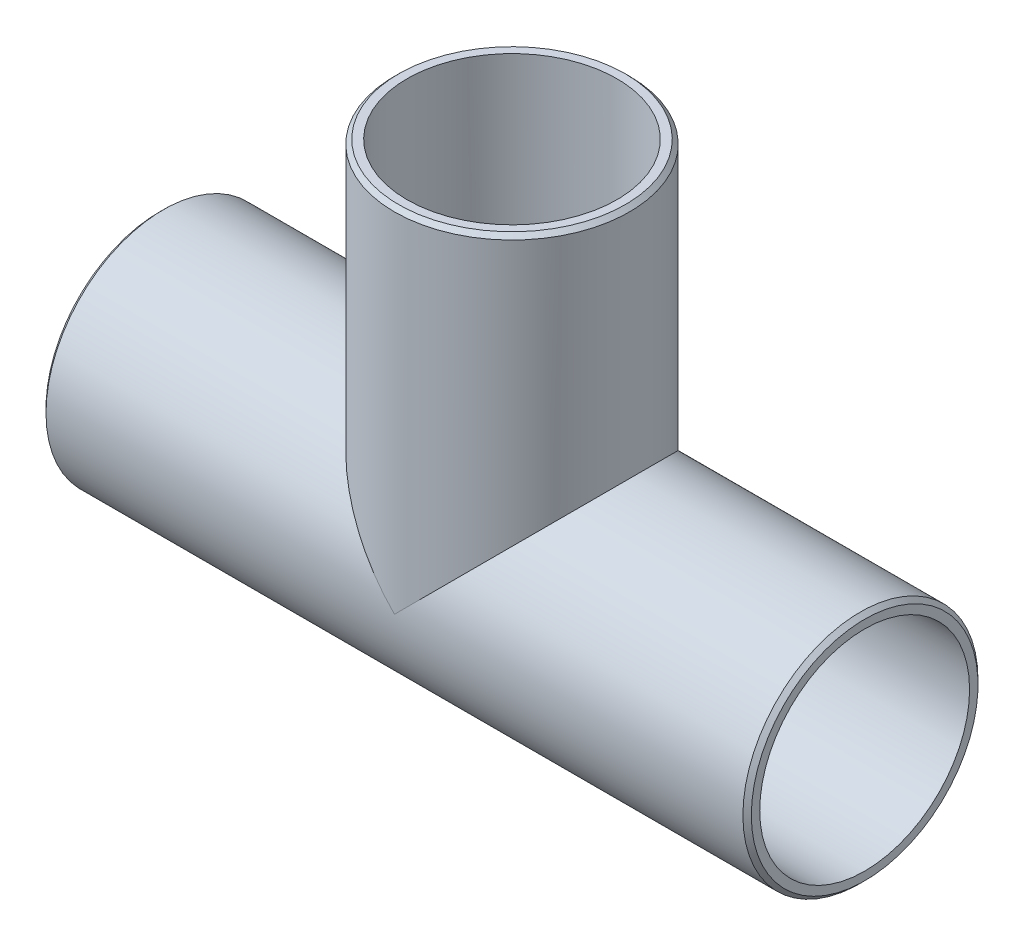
ISO-10303-21;
HEADER;
FILE_DESCRIPTION(('STEP AP214'),'2;1');
FILE_NAME('part.step','',(''),(''),'','','');
FILE_SCHEMA(('AUTOMOTIVE_DESIGN { 1 0 10303 214 1 1 1 1 }'));
ENDSEC;
DATA;
#1=APPLICATION_CONTEXT('core data for automotive mechanical design processes');
#2=APPLICATION_PROTOCOL_DEFINITION('international standard','automotive_design',2000,#1);
#3=PRODUCT_CONTEXT('',#1,'mechanical');
#4=PRODUCT('Part','Part','',(#3));
#5=PRODUCT_RELATED_PRODUCT_CATEGORY('part','',(#4));
#6=PRODUCT_DEFINITION_FORMATION('','',#4);
#7=PRODUCT_DEFINITION_CONTEXT('part definition',#1,'design');
#8=PRODUCT_DEFINITION('design','',#6,#7);
#9=PRODUCT_DEFINITION_SHAPE('','',#8);
#10=(LENGTH_UNIT() NAMED_UNIT(*) SI_UNIT(.MILLI.,.METRE.));
#11=(NAMED_UNIT(*) PLANE_ANGLE_UNIT() SI_UNIT($,.RADIAN.));
#12=(NAMED_UNIT(*) SI_UNIT($,.STERADIAN.) SOLID_ANGLE_UNIT());
#13=UNCERTAINTY_MEASURE_WITH_UNIT(LENGTH_MEASURE(1.E-05),#10,'distance_accuracy_value','');
#14=(GEOMETRIC_REPRESENTATION_CONTEXT(3) GLOBAL_UNCERTAINTY_ASSIGNED_CONTEXT((#13)) GLOBAL_UNIT_ASSIGNED_CONTEXT((#10,
#11,#12)) REPRESENTATION_CONTEXT('',''));
#15=CARTESIAN_POINT('',(0.,0.,0.));
#16=DIRECTION('',(0.,0.,1.));
#17=DIRECTION('',(1.,0.,0.));
#18=AXIS2_PLACEMENT_3D('',#15,#16,#17);
#19=CARTESIAN_POINT('',(-133.35,0.,0.));
#20=DIRECTION('',(-1.,0.,0.));
#21=DIRECTION('',(0.,0.,-1.));
#22=AXIS2_PLACEMENT_3D('',#19,#20,#21);
#23=PLANE('',#22);
#24=CARTESIAN_POINT('',(-133.35,0.,0.));
#25=DIRECTION('',(-1.,0.,0.));
#26=DIRECTION('',(0.,0.,1.));
#27=AXIS2_PLACEMENT_3D('',#24,#25,#26);
#28=CIRCLE('',#27,42.8582666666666);
#29=CARTESIAN_POINT('',(-133.35,0.,-42.8582666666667));
#30=VERTEX_POINT('',#29);
#31=EDGE_CURVE('E42',#30,#30,#28,.T.);
#32=ORIENTED_EDGE('',*,*,#31,.T.);
#33=EDGE_LOOP('',(#32));
#34=FACE_BOUND('',#33,.T.);
#35=CARTESIAN_POINT('',(-133.35,0.,0.));
#36=DIRECTION('',(-1.,0.,0.));
#37=DIRECTION('',(0.,0.,1.));
#38=AXIS2_PLACEMENT_3D('',#35,#36,#37);
#39=CIRCLE('',#38,39.6748);
#40=CARTESIAN_POINT('',(-133.35,0.,39.6748));
#41=VERTEX_POINT('',#40);
#42=EDGE_CURVE('E69',#41,#41,#39,.F.);
#43=ORIENTED_EDGE('',*,*,#42,.T.);
#44=EDGE_LOOP('',(#43));
#45=FACE_BOUND('',#44,.T.);
#46=ADVANCED_FACE('F34',(#34,#45),#23,.T.);
#47=CARTESIAN_POINT('',(133.35,0.,0.));
#48=DIRECTION('',(-1.,0.,0.));
#49=DIRECTION('',(0.,0.,1.));
#50=AXIS2_PLACEMENT_3D('',#47,#48,#49);
#51=CYLINDRICAL_SURFACE('',#50,44.45);
#52=CARTESIAN_POINT('',(-131.758266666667,0.,0.));
#53=DIRECTION('',(-1.,0.,0.));
#54=DIRECTION('',(0.,0.,1.));
#55=AXIS2_PLACEMENT_3D('',#52,#53,#54);
#56=CIRCLE('',#55,44.45);
#57=CARTESIAN_POINT('',(-131.758266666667,0.,-44.45));
#58=VERTEX_POINT('',#57);
#59=EDGE_CURVE('E88',#58,#58,#56,.F.);
#60=ORIENTED_EDGE('',*,*,#59,.T.);
#61=EDGE_LOOP('',(#60));
#62=FACE_BOUND('',#61,.T.);
#63=CARTESIAN_POINT('',(131.758266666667,0.,0.));
#64=DIRECTION('',(1.,0.,0.));
#65=DIRECTION('',(0.,0.,-1.));
#66=AXIS2_PLACEMENT_3D('',#63,#64,#65);
#67=CIRCLE('',#66,44.45);
#68=CARTESIAN_POINT('',(131.758266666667,0.,44.45));
#69=VERTEX_POINT('',#68);
#70=EDGE_CURVE('E85',#69,#69,#67,.F.);
#71=ORIENTED_EDGE('',*,*,#70,.T.);
#72=EDGE_LOOP('',(#71));
#73=FACE_BOUND('',#72,.T.);
#74=CARTESIAN_POINT('',(0.,0.,0.));
#75=DIRECTION('',(-0.707106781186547,-0.707106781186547,0.));
#76=DIRECTION('',(-0.707106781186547,0.707106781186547,0.));
#77=AXIS2_PLACEMENT_3D('',#74,#75,#76);
#78=ELLIPSE('',#77,62.8617928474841,44.45);
#79=CARTESIAN_POINT('',(0.,0.,-44.45));
#80=VERTEX_POINT('',#79);
#81=CARTESIAN_POINT('',(0.,0.,44.45));
#82=VERTEX_POINT('',#81);
#83=EDGE_CURVE('E51',#80,#82,#78,.F.);
#84=ORIENTED_EDGE('',*,*,#83,.F.);
#85=CARTESIAN_POINT('',(0.,0.,0.));
#86=DIRECTION('',(-0.707106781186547,0.707106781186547,0.));
#87=DIRECTION('',(-0.707106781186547,-0.707106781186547,0.));
#88=AXIS2_PLACEMENT_3D('',#85,#86,#87);
#89=ELLIPSE('',#88,62.8617928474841,44.45);
#90=EDGE_CURVE('E48',#82,#80,#89,.T.);
#91=ORIENTED_EDGE('',*,*,#90,.F.);
#92=EDGE_LOOP('',(#84,#91));
#93=FACE_BOUND('',#92,.T.);
#94=ADVANCED_FACE('F36',(#62,#73,#93),#51,.T.);
#95=CARTESIAN_POINT('',(133.35,0.,0.));
#96=DIRECTION('',(1.,0.,0.));
#97=DIRECTION('',(0.,0.,-1.));
#98=AXIS2_PLACEMENT_3D('',#95,#96,#97);
#99=PLANE('',#98);
#100=CARTESIAN_POINT('',(133.35,0.,0.));
#101=DIRECTION('',(1.,0.,0.));
#102=DIRECTION('',(0.,0.,-1.));
#103=AXIS2_PLACEMENT_3D('',#100,#101,#102);
#104=CIRCLE('',#103,42.8582666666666);
#105=CARTESIAN_POINT('',(133.35,0.,42.8582666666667));
#106=VERTEX_POINT('',#105);
#107=EDGE_CURVE('E11',#106,#106,#104,.T.);
#108=ORIENTED_EDGE('',*,*,#107,.T.);
#109=EDGE_LOOP('',(#108));
#110=FACE_BOUND('',#109,.T.);
#111=CARTESIAN_POINT('',(133.35,0.,0.));
#112=DIRECTION('',(1.,0.,0.));
#113=DIRECTION('',(0.,0.,-1.));
#114=AXIS2_PLACEMENT_3D('',#111,#112,#113);
#115=CIRCLE('',#114,39.6748);
#116=CARTESIAN_POINT('',(133.35,0.,-39.6748));
#117=VERTEX_POINT('',#116);
#118=EDGE_CURVE('E66',#117,#117,#115,.T.);
#119=ORIENTED_EDGE('',*,*,#118,.F.);
#120=EDGE_LOOP('',(#119));
#121=FACE_BOUND('',#120,.T.);
#122=ADVANCED_FACE('F105',(#110,#121),#99,.T.);
#123=CARTESIAN_POINT('',(0.,133.35,0.));
#124=DIRECTION('',(0.,-1.,0.));
#125=DIRECTION('',(0.,0.,-1.));
#126=AXIS2_PLACEMENT_3D('',#123,#124,#125);
#127=CYLINDRICAL_SURFACE('',#126,44.45);
#128=CARTESIAN_POINT('',(0.,131.758266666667,0.));
#129=DIRECTION('',(0.,1.,0.));
#130=DIRECTION('',(0.,0.,1.));
#131=AXIS2_PLACEMENT_3D('',#128,#129,#130);
#132=CIRCLE('',#131,44.45);
#133=CARTESIAN_POINT('',(0.,131.758266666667,-44.45));
#134=VERTEX_POINT('',#133);
#135=EDGE_CURVE('E82',#134,#134,#132,.F.);
#136=ORIENTED_EDGE('',*,*,#135,.T.);
#137=EDGE_LOOP('',(#136));
#138=FACE_BOUND('',#137,.T.);
#139=ORIENTED_EDGE('',*,*,#90,.T.);
#140=ORIENTED_EDGE('',*,*,#83,.T.);
#141=EDGE_LOOP('',(#139,#140));
#142=FACE_BOUND('',#141,.T.);
#143=ADVANCED_FACE('F115',(#138,#142),#127,.T.);
#144=CARTESIAN_POINT('',(0.,133.35,0.));
#145=DIRECTION('',(0.,1.,0.));
#146=DIRECTION('',(0.,0.,1.));
#147=AXIS2_PLACEMENT_3D('',#144,#145,#146);
#148=PLANE('',#147);
#149=CARTESIAN_POINT('',(0.,133.35,0.));
#150=DIRECTION('',(0.,1.,0.));
#151=DIRECTION('',(0.,0.,1.));
#152=AXIS2_PLACEMENT_3D('',#149,#150,#151);
#153=CIRCLE('',#152,42.8582666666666);
#154=CARTESIAN_POINT('',(0.,133.35,-42.8582666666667));
#155=VERTEX_POINT('',#154);
#156=EDGE_CURVE('E79',#155,#155,#153,.T.);
#157=ORIENTED_EDGE('',*,*,#156,.T.);
#158=EDGE_LOOP('',(#157));
#159=FACE_BOUND('',#158,.T.);
#160=CARTESIAN_POINT('',(0.,133.35,0.));
#161=DIRECTION('',(0.,1.,0.));
#162=DIRECTION('',(0.,0.,1.));
#163=AXIS2_PLACEMENT_3D('',#160,#161,#162);
#164=CIRCLE('',#163,39.6748);
#165=CARTESIAN_POINT('',(0.,133.35,39.6748));
#166=VERTEX_POINT('',#165);
#167=EDGE_CURVE('E73',#166,#166,#164,.T.);
#168=ORIENTED_EDGE('',*,*,#167,.F.);
#169=EDGE_LOOP('',(#168));
#170=FACE_BOUND('',#169,.T.);
#171=ADVANCED_FACE('F119',(#159,#170),#148,.T.);
#172=CARTESIAN_POINT('',(133.35,0.,0.));
#173=DIRECTION('',(-1.,0.,0.));
#174=DIRECTION('',(0.,0.,1.));
#175=AXIS2_PLACEMENT_3D('',#172,#173,#174);
#176=CYLINDRICAL_SURFACE('',#175,39.6748);
#177=ORIENTED_EDGE('',*,*,#42,.F.);
#178=EDGE_LOOP('',(#177));
#179=FACE_BOUND('',#178,.T.);
#180=ORIENTED_EDGE('',*,*,#118,.T.);
#181=EDGE_LOOP('',(#180));
#182=FACE_BOUND('',#181,.T.);
#183=CARTESIAN_POINT('',(0.,0.,0.));
#184=DIRECTION('',(-0.707106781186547,-0.707106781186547,0.));
#185=DIRECTION('',(-0.707106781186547,0.707106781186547,0.));
#186=AXIS2_PLACEMENT_3D('',#183,#184,#185);
#187=ELLIPSE('',#186,56.1086402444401,39.6748);
#188=CARTESIAN_POINT('',(0.,0.,-39.6748));
#189=VERTEX_POINT('',#188);
#190=CARTESIAN_POINT('',(0.,0.,39.6748));
#191=VERTEX_POINT('',#190);
#192=EDGE_CURVE('E59',#189,#191,#187,.F.);
#193=ORIENTED_EDGE('',*,*,#192,.T.);
#194=CARTESIAN_POINT('',(0.,0.,0.));
#195=DIRECTION('',(-0.707106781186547,0.707106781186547,0.));
#196=DIRECTION('',(-0.707106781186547,-0.707106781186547,0.));
#197=AXIS2_PLACEMENT_3D('',#194,#195,#196);
#198=ELLIPSE('',#197,56.1086402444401,39.6748);
#199=EDGE_CURVE('E62',#191,#189,#198,.T.);
#200=ORIENTED_EDGE('',*,*,#199,.T.);
#201=EDGE_LOOP('',(#193,#200));
#202=FACE_BOUND('',#201,.T.);
#203=ADVANCED_FACE('F65',(#179,#182,#202),#176,.F.);
#204=CARTESIAN_POINT('',(0.,133.35,0.));
#205=DIRECTION('',(0.,-1.,0.));
#206=DIRECTION('',(0.,0.,-1.));
#207=AXIS2_PLACEMENT_3D('',#204,#205,#206);
#208=CYLINDRICAL_SURFACE('',#207,39.6748);
#209=ORIENTED_EDGE('',*,*,#167,.T.);
#210=EDGE_LOOP('',(#209));
#211=FACE_BOUND('',#210,.T.);
#212=ORIENTED_EDGE('',*,*,#199,.F.);
#213=ORIENTED_EDGE('',*,*,#192,.F.);
#214=EDGE_LOOP('',(#212,#213));
#215=FACE_BOUND('',#214,.T.);
#216=ADVANCED_FACE('F61',(#211,#215),#208,.F.);
#217=CARTESIAN_POINT('',(0.,133.35,0.));
#218=DIRECTION('',(0.,-1.,0.));
#219=DIRECTION('',(0.,0.,-1.));
#220=AXIS2_PLACEMENT_3D('',#217,#218,#219);
#221=CONICAL_SURFACE('',#220,42.8582666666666,0.785398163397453);
#222=CARTESIAN_POINT('',(0.,131.758266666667,-44.45));
#223=CARTESIAN_POINT('',(0.,131.774847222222,-44.4334194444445));
#224=CARTESIAN_POINT('',(0.,131.791427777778,-44.4168388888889));
#225=CARTESIAN_POINT('',(0.,131.824588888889,-44.3836777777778));
#226=CARTESIAN_POINT('',(0.,131.841169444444,-44.3670972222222));
#227=CARTESIAN_POINT('',(0.,131.874330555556,-44.3339361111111));
#228=CARTESIAN_POINT('',(0.,131.890911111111,-44.3173555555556));
#229=CARTESIAN_POINT('',(0.,131.924072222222,-44.2841944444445));
#230=CARTESIAN_POINT('',(0.,131.940652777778,-44.2676138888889));
#231=CARTESIAN_POINT('',(0.,131.973813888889,-44.2344527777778));
#232=CARTESIAN_POINT('',(0.,131.990394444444,-44.2178722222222));
#233=CARTESIAN_POINT('',(0.,132.023555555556,-44.1847111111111));
#234=CARTESIAN_POINT('',(0.,132.040136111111,-44.1681305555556));
#235=CARTESIAN_POINT('',(0.,132.073297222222,-44.1349694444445));
#236=CARTESIAN_POINT('',(0.,132.089877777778,-44.1183888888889));
#237=CARTESIAN_POINT('',(0.,132.123038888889,-44.0852277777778));
#238=CARTESIAN_POINT('',(0.,132.139619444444,-44.0686472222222));
#239=CARTESIAN_POINT('',(0.,132.172780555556,-44.0354861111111));
#240=CARTESIAN_POINT('',(0.,132.189361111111,-44.0189055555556));
#241=CARTESIAN_POINT('',(0.,132.222522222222,-43.9857444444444));
#242=CARTESIAN_POINT('',(0.,132.239102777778,-43.9691638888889));
#243=CARTESIAN_POINT('',(0.,132.272263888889,-43.9360027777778));
#244=CARTESIAN_POINT('',(0.,132.288844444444,-43.9194222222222));
#245=CARTESIAN_POINT('',(0.,132.322005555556,-43.8862611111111));
#246=CARTESIAN_POINT('',(0.,132.338586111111,-43.8696805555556));
#247=CARTESIAN_POINT('',(0.,132.371747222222,-43.8365194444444));
#248=CARTESIAN_POINT('',(0.,132.388327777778,-43.8199388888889));
#249=CARTESIAN_POINT('',(0.,132.421488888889,-43.7867777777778));
#250=CARTESIAN_POINT('',(0.,132.438069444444,-43.7701972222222));
#251=CARTESIAN_POINT('',(0.,132.471230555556,-43.7370361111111));
#252=CARTESIAN_POINT('',(0.,132.487811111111,-43.7204555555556));
#253=CARTESIAN_POINT('',(0.,132.520972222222,-43.6872944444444));
#254=CARTESIAN_POINT('',(0.,132.537552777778,-43.6707138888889));
#255=CARTESIAN_POINT('',(0.,132.570713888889,-43.6375527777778));
#256=CARTESIAN_POINT('',(0.,132.587294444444,-43.6209722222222));
#257=CARTESIAN_POINT('',(0.,132.620455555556,-43.5878111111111));
#258=CARTESIAN_POINT('',(0.,132.637036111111,-43.5712305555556));
#259=CARTESIAN_POINT('',(0.,132.670197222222,-43.5380694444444));
#260=CARTESIAN_POINT('',(0.,132.686777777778,-43.5214888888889));
#261=CARTESIAN_POINT('',(0.,132.719938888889,-43.4883277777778));
#262=CARTESIAN_POINT('',(0.,132.736519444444,-43.4717472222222));
#263=CARTESIAN_POINT('',(0.,132.769680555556,-43.4385861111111));
#264=CARTESIAN_POINT('',(0.,132.786261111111,-43.4220055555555));
#265=CARTESIAN_POINT('',(0.,132.819422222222,-43.3888444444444));
#266=CARTESIAN_POINT('',(0.,132.836002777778,-43.3722638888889));
#267=CARTESIAN_POINT('',(0.,132.869163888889,-43.3391027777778));
#268=CARTESIAN_POINT('',(0.,132.885744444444,-43.3225222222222));
#269=CARTESIAN_POINT('',(0.,132.918905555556,-43.2893611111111));
#270=CARTESIAN_POINT('',(0.,132.935486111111,-43.2727805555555));
#271=CARTESIAN_POINT('',(0.,132.968647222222,-43.2396194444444));
#272=CARTESIAN_POINT('',(0.,132.985227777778,-43.2230388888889));
#273=CARTESIAN_POINT('',(0.,133.018388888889,-43.1898777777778));
#274=CARTESIAN_POINT('',(0.,133.034969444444,-43.1732972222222));
#275=CARTESIAN_POINT('',(0.,133.068130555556,-43.1401361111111));
#276=CARTESIAN_POINT('',(0.,133.084711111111,-43.1235555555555));
#277=CARTESIAN_POINT('',(0.,133.117872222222,-43.0903944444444));
#278=CARTESIAN_POINT('',(0.,133.134452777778,-43.0738138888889));
#279=CARTESIAN_POINT('',(0.,133.167613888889,-43.0406527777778));
#280=CARTESIAN_POINT('',(0.,133.184194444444,-43.0240722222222));
#281=CARTESIAN_POINT('',(0.,133.217355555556,-42.9909111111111));
#282=CARTESIAN_POINT('',(0.,133.233936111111,-42.9743305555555));
#283=CARTESIAN_POINT('',(0.,133.267097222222,-42.9411694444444));
#284=CARTESIAN_POINT('',(0.,133.283677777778,-42.9245888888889));
#285=CARTESIAN_POINT('',(0.,133.316838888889,-42.8914277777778));
#286=CARTESIAN_POINT('',(0.,133.333419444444,-42.8748472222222));
#287=CARTESIAN_POINT('',(0.,133.35,-42.8582666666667));
#288=B_SPLINE_CURVE_WITH_KNOTS('',3,(#222,#223,#224,#225,#226,#227,#228,#229,#230,#231,#232,
#233,#234,#235,#236,#237,#238,#239,#240,#241,#242,#243,#244,#245,#246,#247,#248,#249,#250,#251,
#252,#253,#254,#255,#256,#257,#258,#259,#260,#261,#262,#263,#264,#265,#266,#267,#268,#269,#270,
#271,#272,#273,#274,#275,#276,#277,#278,#279,#280,#281,#282,#283,#284,#285,#286,#287),
.UNSPECIFIED.,.F.,.F.,(4,2,2,2,2,2,2,2,2,2,2,2,2,2,2,2,2,2,2,2,2,2,2,2,2,2,2,2,2,2,2,2,4),(0.,
0.0703453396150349,0.140690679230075,0.211036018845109,0.281381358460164,0.351726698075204,
0.422072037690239,0.492417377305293,0.562762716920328,0.633108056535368,0.703453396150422,
0.773798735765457,0.844144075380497,0.914489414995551,0.984834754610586,1.05518009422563,
1.12552543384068,1.19587077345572,1.26621611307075,1.33656145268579,1.40690679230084,
1.47725213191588,1.54759747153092,1.61794281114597,1.68828815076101,1.75863349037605,
1.8289788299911,1.89932416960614,1.96966950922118,2.04001484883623,2.11036018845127,
2.18070552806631,2.25105086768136),.UNSPECIFIED.);
#289=EDGE_CURVE('BSEAM99',#134,#155,#288,.T.);
#290=ORIENTED_EDGE('',*,*,#135,.F.);
#291=ORIENTED_EDGE('',*,*,#156,.F.);
#292=ORIENTED_EDGE('',*,*,#289,.T.);
#293=ORIENTED_EDGE('',*,*,#289,.F.);
#294=EDGE_LOOP('',(#290,#292,#291,#293));
#295=FACE_BOUND('',#294,.T.);
#296=ADVANCED_FACE('F99',(#295),#221,.T.);
#297=CARTESIAN_POINT('',(-131.758266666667,0.,0.));
#298=DIRECTION('',(1.,0.,0.));
#299=DIRECTION('',(0.,0.,-1.));
#300=AXIS2_PLACEMENT_3D('',#297,#298,#299);
#301=CONICAL_SURFACE('',#300,44.45,0.785398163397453);
#302=CARTESIAN_POINT('',(-133.35,0.,-42.8582666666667));
#303=CARTESIAN_POINT('',(-133.333419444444,0.,-42.8748472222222));
#304=CARTESIAN_POINT('',(-133.316838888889,0.,-42.8914277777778));
#305=CARTESIAN_POINT('',(-133.283677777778,0.,-42.9245888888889));
#306=CARTESIAN_POINT('',(-133.267097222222,0.,-42.9411694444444));
#307=CARTESIAN_POINT('',(-133.233936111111,0.,-42.9743305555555));
#308=CARTESIAN_POINT('',(-133.217355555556,0.,-42.9909111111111));
#309=CARTESIAN_POINT('',(-133.184194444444,0.,-43.0240722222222));
#310=CARTESIAN_POINT('',(-133.167613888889,0.,-43.0406527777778));
#311=CARTESIAN_POINT('',(-133.134452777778,0.,-43.0738138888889));
#312=CARTESIAN_POINT('',(-133.117872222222,0.,-43.0903944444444));
#313=CARTESIAN_POINT('',(-133.084711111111,0.,-43.1235555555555));
#314=CARTESIAN_POINT('',(-133.068130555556,0.,-43.1401361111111));
#315=CARTESIAN_POINT('',(-133.034969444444,0.,-43.1732972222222));
#316=CARTESIAN_POINT('',(-133.018388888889,0.,-43.1898777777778));
#317=CARTESIAN_POINT('',(-132.985227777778,0.,-43.2230388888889));
#318=CARTESIAN_POINT('',(-132.968647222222,0.,-43.2396194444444));
#319=CARTESIAN_POINT('',(-132.935486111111,0.,-43.2727805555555));
#320=CARTESIAN_POINT('',(-132.918905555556,0.,-43.2893611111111));
#321=CARTESIAN_POINT('',(-132.885744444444,0.,-43.3225222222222));
#322=CARTESIAN_POINT('',(-132.869163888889,0.,-43.3391027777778));
#323=CARTESIAN_POINT('',(-132.836002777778,0.,-43.3722638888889));
#324=CARTESIAN_POINT('',(-132.819422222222,0.,-43.3888444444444));
#325=CARTESIAN_POINT('',(-132.786261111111,0.,-43.4220055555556));
#326=CARTESIAN_POINT('',(-132.769680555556,0.,-43.4385861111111));
#327=CARTESIAN_POINT('',(-132.736519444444,0.,-43.4717472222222));
#328=CARTESIAN_POINT('',(-132.719938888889,0.,-43.4883277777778));
#329=CARTESIAN_POINT('',(-132.686777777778,0.,-43.5214888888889));
#330=CARTESIAN_POINT('',(-132.670197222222,0.,-43.5380694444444));
#331=CARTESIAN_POINT('',(-132.637036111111,0.,-43.5712305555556));
#332=CARTESIAN_POINT('',(-132.620455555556,0.,-43.5878111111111));
#333=CARTESIAN_POINT('',(-132.587294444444,0.,-43.6209722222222));
#334=CARTESIAN_POINT('',(-132.570713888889,0.,-43.6375527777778));
#335=CARTESIAN_POINT('',(-132.537552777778,0.,-43.6707138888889));
#336=CARTESIAN_POINT('',(-132.520972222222,0.,-43.6872944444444));
#337=CARTESIAN_POINT('',(-132.487811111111,0.,-43.7204555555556));
#338=CARTESIAN_POINT('',(-132.471230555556,0.,-43.7370361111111));
#339=CARTESIAN_POINT('',(-132.438069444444,0.,-43.7701972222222));
#340=CARTESIAN_POINT('',(-132.421488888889,0.,-43.7867777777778));
#341=CARTESIAN_POINT('',(-132.388327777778,0.,-43.8199388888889));
#342=CARTESIAN_POINT('',(-132.371747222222,0.,-43.8365194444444));
#343=CARTESIAN_POINT('',(-132.338586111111,0.,-43.8696805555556));
#344=CARTESIAN_POINT('',(-132.322005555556,0.,-43.8862611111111));
#345=CARTESIAN_POINT('',(-132.288844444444,0.,-43.9194222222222));
#346=CARTESIAN_POINT('',(-132.272263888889,0.,-43.9360027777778));
#347=CARTESIAN_POINT('',(-132.239102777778,0.,-43.9691638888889));
#348=CARTESIAN_POINT('',(-132.222522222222,0.,-43.9857444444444));
#349=CARTESIAN_POINT('',(-132.189361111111,0.,-44.0189055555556));
#350=CARTESIAN_POINT('',(-132.172780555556,0.,-44.0354861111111));
#351=CARTESIAN_POINT('',(-132.139619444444,0.,-44.0686472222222));
#352=CARTESIAN_POINT('',(-132.123038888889,0.,-44.0852277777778));
#353=CARTESIAN_POINT('',(-132.089877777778,0.,-44.1183888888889));
#354=CARTESIAN_POINT('',(-132.073297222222,0.,-44.1349694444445));
#355=CARTESIAN_POINT('',(-132.040136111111,0.,-44.1681305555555));
#356=CARTESIAN_POINT('',(-132.023555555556,0.,-44.1847111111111));
#357=CARTESIAN_POINT('',(-131.990394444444,0.,-44.2178722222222));
#358=CARTESIAN_POINT('',(-131.973813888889,0.,-44.2344527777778));
#359=CARTESIAN_POINT('',(-131.940652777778,0.,-44.2676138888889));
#360=CARTESIAN_POINT('',(-131.924072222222,0.,-44.2841944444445));
#361=CARTESIAN_POINT('',(-131.890911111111,0.,-44.3173555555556));
#362=CARTESIAN_POINT('',(-131.874330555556,0.,-44.3339361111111));
#363=CARTESIAN_POINT('',(-131.841169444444,0.,-44.3670972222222));
#364=CARTESIAN_POINT('',(-131.824588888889,0.,-44.3836777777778));
#365=CARTESIAN_POINT('',(-131.791427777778,0.,-44.4168388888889));
#366=CARTESIAN_POINT('',(-131.774847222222,0.,-44.4334194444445));
#367=CARTESIAN_POINT('',(-131.758266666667,0.,-44.45));
#368=B_SPLINE_CURVE_WITH_KNOTS('',3,(#302,#303,#304,#305,#306,#307,#308,#309,#310,#311,#312,
#313,#314,#315,#316,#317,#318,#319,#320,#321,#322,#323,#324,#325,#326,#327,#328,#329,#330,#331,
#332,#333,#334,#335,#336,#337,#338,#339,#340,#341,#342,#343,#344,#345,#346,#347,#348,#349,#350,
#351,#352,#353,#354,#355,#356,#357,#358,#359,#360,#361,#362,#363,#364,#365,#366,#367),
.UNSPECIFIED.,.F.,.F.,(4,2,2,2,2,2,2,2,2,2,2,2,2,2,2,2,2,2,2,2,2,2,2,2,2,2,2,2,2,2,2,2,4),(0.,
0.0703453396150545,0.140690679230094,0.211036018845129,0.281381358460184,0.351726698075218,
0.422072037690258,0.492417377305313,0.562762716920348,0.633108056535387,0.703453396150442,
0.773798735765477,0.844144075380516,0.914489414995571,0.984834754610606,1.05518009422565,
1.12552543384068,1.19587077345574,1.26621611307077,1.33656145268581,1.40690679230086,
1.4772521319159,1.54759747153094,1.61794281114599,1.68828815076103,1.75863349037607,
1.82897882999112,1.89932416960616,1.9696695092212,2.04001484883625,2.11036018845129,
2.18070552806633,2.25105086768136),.UNSPECIFIED.);
#369=EDGE_CURVE('BSEAM95',#30,#58,#368,.T.);
#370=ORIENTED_EDGE('',*,*,#31,.F.);
#371=ORIENTED_EDGE('',*,*,#59,.F.);
#372=ORIENTED_EDGE('',*,*,#369,.T.);
#373=ORIENTED_EDGE('',*,*,#369,.F.);
#374=EDGE_LOOP('',(#370,#372,#371,#373));
#375=FACE_BOUND('',#374,.T.);
#376=ADVANCED_FACE('F95',(#375),#301,.T.);
#377=CARTESIAN_POINT('',(133.35,0.,0.));
#378=DIRECTION('',(-1.,0.,0.));
#379=DIRECTION('',(0.,0.,1.));
#380=AXIS2_PLACEMENT_3D('',#377,#378,#379);
#381=CONICAL_SURFACE('',#380,42.8582666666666,0.785398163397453);
#382=CARTESIAN_POINT('',(131.758266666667,0.,44.45));
#383=CARTESIAN_POINT('',(131.774847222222,0.,44.4334194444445));
#384=CARTESIAN_POINT('',(131.791427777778,0.,44.4168388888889));
#385=CARTESIAN_POINT('',(131.824588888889,0.,44.3836777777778));
#386=CARTESIAN_POINT('',(131.841169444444,0.,44.3670972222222));
#387=CARTESIAN_POINT('',(131.874330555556,0.,44.3339361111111));
#388=CARTESIAN_POINT('',(131.890911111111,0.,44.3173555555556));
#389=CARTESIAN_POINT('',(131.924072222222,0.,44.2841944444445));
#390=CARTESIAN_POINT('',(131.940652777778,0.,44.2676138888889));
#391=CARTESIAN_POINT('',(131.973813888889,0.,44.2344527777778));
#392=CARTESIAN_POINT('',(131.990394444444,0.,44.2178722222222));
#393=CARTESIAN_POINT('',(132.023555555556,0.,44.1847111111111));
#394=CARTESIAN_POINT('',(132.040136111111,0.,44.1681305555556));
#395=CARTESIAN_POINT('',(132.073297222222,0.,44.1349694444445));
#396=CARTESIAN_POINT('',(132.089877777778,0.,44.1183888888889));
#397=CARTESIAN_POINT('',(132.123038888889,0.,44.0852277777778));
#398=CARTESIAN_POINT('',(132.139619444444,0.,44.0686472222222));
#399=CARTESIAN_POINT('',(132.172780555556,0.,44.0354861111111));
#400=CARTESIAN_POINT('',(132.189361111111,0.,44.0189055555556));
#401=CARTESIAN_POINT('',(132.222522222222,0.,43.9857444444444));
#402=CARTESIAN_POINT('',(132.239102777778,0.,43.9691638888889));
#403=CARTESIAN_POINT('',(132.272263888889,0.,43.9360027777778));
#404=CARTESIAN_POINT('',(132.288844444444,0.,43.9194222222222));
#405=CARTESIAN_POINT('',(132.322005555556,0.,43.8862611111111));
#406=CARTESIAN_POINT('',(132.338586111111,0.,43.8696805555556));
#407=CARTESIAN_POINT('',(132.371747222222,0.,43.8365194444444));
#408=CARTESIAN_POINT('',(132.388327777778,0.,43.8199388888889));
#409=CARTESIAN_POINT('',(132.421488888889,0.,43.7867777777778));
#410=CARTESIAN_POINT('',(132.438069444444,0.,43.7701972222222));
#411=CARTESIAN_POINT('',(132.471230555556,0.,43.7370361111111));
#412=CARTESIAN_POINT('',(132.487811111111,0.,43.7204555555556));
#413=CARTESIAN_POINT('',(132.520972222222,0.,43.6872944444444));
#414=CARTESIAN_POINT('',(132.537552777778,0.,43.6707138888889));
#415=CARTESIAN_POINT('',(132.570713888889,0.,43.6375527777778));
#416=CARTESIAN_POINT('',(132.587294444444,0.,43.6209722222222));
#417=CARTESIAN_POINT('',(132.620455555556,0.,43.5878111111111));
#418=CARTESIAN_POINT('',(132.637036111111,0.,43.5712305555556));
#419=CARTESIAN_POINT('',(132.670197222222,0.,43.5380694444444));
#420=CARTESIAN_POINT('',(132.686777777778,0.,43.5214888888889));
#421=CARTESIAN_POINT('',(132.719938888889,0.,43.4883277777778));
#422=CARTESIAN_POINT('',(132.736519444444,0.,43.4717472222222));
#423=CARTESIAN_POINT('',(132.769680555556,0.,43.4385861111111));
#424=CARTESIAN_POINT('',(132.786261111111,0.,43.4220055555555));
#425=CARTESIAN_POINT('',(132.819422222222,0.,43.3888444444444));
#426=CARTESIAN_POINT('',(132.836002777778,0.,43.3722638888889));
#427=CARTESIAN_POINT('',(132.869163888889,0.,43.3391027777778));
#428=CARTESIAN_POINT('',(132.885744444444,0.,43.3225222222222));
#429=CARTESIAN_POINT('',(132.918905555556,0.,43.2893611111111));
#430=CARTESIAN_POINT('',(132.935486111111,0.,43.2727805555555));
#431=CARTESIAN_POINT('',(132.968647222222,0.,43.2396194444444));
#432=CARTESIAN_POINT('',(132.985227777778,0.,43.2230388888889));
#433=CARTESIAN_POINT('',(133.018388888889,0.,43.1898777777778));
#434=CARTESIAN_POINT('',(133.034969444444,0.,43.1732972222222));
#435=CARTESIAN_POINT('',(133.068130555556,0.,43.1401361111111));
#436=CARTESIAN_POINT('',(133.084711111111,0.,43.1235555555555));
#437=CARTESIAN_POINT('',(133.117872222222,0.,43.0903944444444));
#438=CARTESIAN_POINT('',(133.134452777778,0.,43.0738138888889));
#439=CARTESIAN_POINT('',(133.167613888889,0.,43.0406527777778));
#440=CARTESIAN_POINT('',(133.184194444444,0.,43.0240722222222));
#441=CARTESIAN_POINT('',(133.217355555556,0.,42.9909111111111));
#442=CARTESIAN_POINT('',(133.233936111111,0.,42.9743305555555));
#443=CARTESIAN_POINT('',(133.267097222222,0.,42.9411694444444));
#444=CARTESIAN_POINT('',(133.283677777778,0.,42.9245888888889));
#445=CARTESIAN_POINT('',(133.316838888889,0.,42.8914277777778));
#446=CARTESIAN_POINT('',(133.333419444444,0.,42.8748472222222));
#447=CARTESIAN_POINT('',(133.35,0.,42.8582666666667));
#448=B_SPLINE_CURVE_WITH_KNOTS('',3,(#382,#383,#384,#385,#386,#387,#388,#389,#390,#391,#392,
#393,#394,#395,#396,#397,#398,#399,#400,#401,#402,#403,#404,#405,#406,#407,#408,#409,#410,#411,
#412,#413,#414,#415,#416,#417,#418,#419,#420,#421,#422,#423,#424,#425,#426,#427,#428,#429,#430,
#431,#432,#433,#434,#435,#436,#437,#438,#439,#440,#441,#442,#443,#444,#445,#446,#447),
.UNSPECIFIED.,.F.,.F.,(4,2,2,2,2,2,2,2,2,2,2,2,2,2,2,2,2,2,2,2,2,2,2,2,2,2,2,2,2,2,2,2,4),(0.,
0.0703453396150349,0.140690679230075,0.211036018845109,0.281381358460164,0.351726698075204,
0.422072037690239,0.492417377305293,0.562762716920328,0.633108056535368,0.703453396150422,
0.773798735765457,0.844144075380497,0.914489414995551,0.984834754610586,1.05518009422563,
1.12552543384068,1.19587077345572,1.26621611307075,1.33656145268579,1.40690679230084,
1.47725213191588,1.54759747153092,1.61794281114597,1.68828815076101,1.75863349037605,
1.8289788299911,1.89932416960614,1.96966950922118,2.04001484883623,2.11036018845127,
2.18070552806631,2.25105086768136),.UNSPECIFIED.);
#449=EDGE_CURVE('BSEAM98',#69,#106,#448,.T.);
#450=ORIENTED_EDGE('',*,*,#70,.F.);
#451=ORIENTED_EDGE('',*,*,#107,.F.);
#452=ORIENTED_EDGE('',*,*,#449,.T.);
#453=ORIENTED_EDGE('',*,*,#449,.F.);
#454=EDGE_LOOP('',(#450,#452,#451,#453));
#455=FACE_BOUND('',#454,.T.);
#456=ADVANCED_FACE('F98',(#455),#381,.T.);
#457=CLOSED_SHELL('',(#46,#94,#122,#143,#171,#203,#216,#296,#376,#456));
#458=MANIFOLD_SOLID_BREP('B2',#457);
#459=ADVANCED_BREP_SHAPE_REPRESENTATION('',(#18,#458),#14);
#460=SHAPE_DEFINITION_REPRESENTATION(#9,#459);
ENDSEC;
END-ISO-10303-21;
